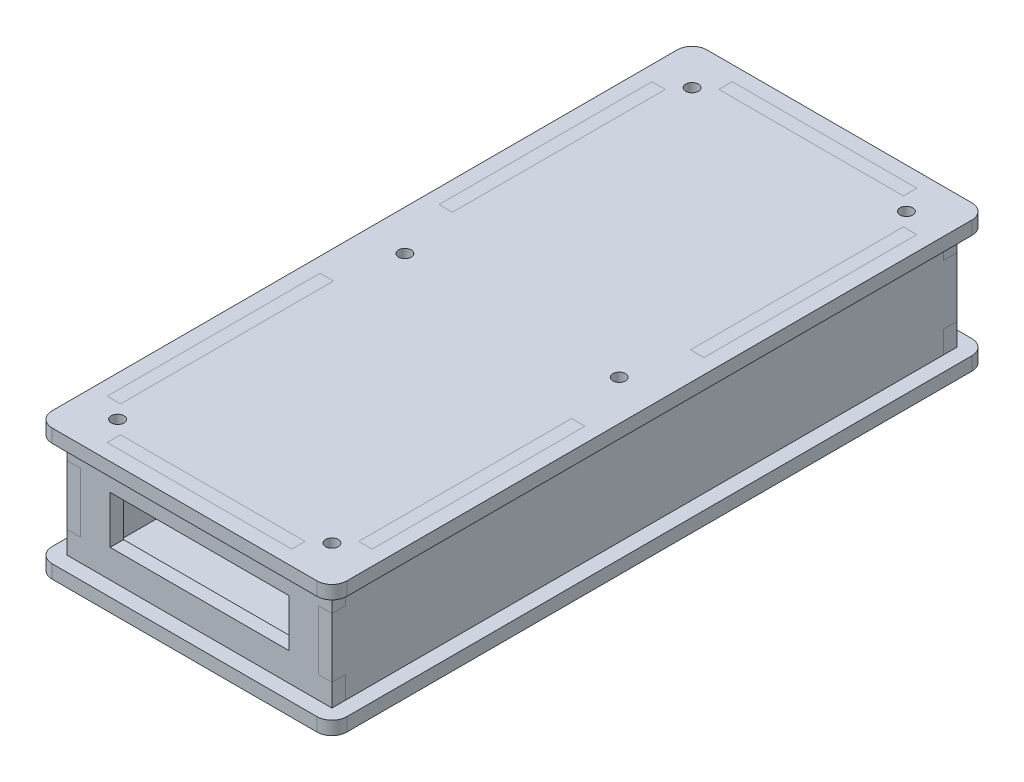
from build123d import *

# Parameters (mm, degrees)
SKETCH2_R           = 2.125
SKETCH2_W           = 62
SKETCH2_H           = 4.5
SKETCH2_W_2         = 4.5
SKETCH2_H_2         = 71.5
BOSS_EXTRUDE1_DEPTH = 4.5
BOSS_EXTRUDE2_DEPTH = 4.5
SKETCH4_W           = 60
SKETCH4_H           = 16
BOSS_EXTRUDE3_DEPTH = 4.5
BOSS_EXTRUDE4_DEPTH = 4.5
SKETCH6_W           = 4.5
SKETCH6_H           = 71.5
SKETCH6_R           = 2.125
SKETCH6_W_2         = 62
SKETCH6_H_2         = 4.5
BOSS_EXTRUDE5_DEPTH = 4.5


with BuildPart() as part:
    # Sketch2 → Boss-Extrude1 (new body)
    with BuildSketch(Plane(origin=(0, 0, 0), x_dir=(1, 0, 0), z_dir=(0, 1, 0))):
        with BuildLine():
            Line((-44.5, 72), (44.5, 72))
            ThreePointArc((44.5, 72), (48.035533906, 70.535533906), (49.5, 67))
            Line((49.5, 67), (49.5, -143))
            ThreePointArc((49.5, -143), (48.035533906, -146.535533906), (44.5, -148))
            Line((44.5, -148), (-44.5, -148))
            ThreePointArc((-44.5, -148), (-48.035533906, -146.535533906), (-49.5, -143))
            Line((-49.5, -143), (-49.5, 67))
            ThreePointArc((-49.5, 67), (-48.035533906, 70.535533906), (-44.5, 72))
        make_face()
        with Locations(Location((-36, 58.5, 0), (0, 0, 270))):
            Circle(SKETCH2_R, mode=Mode.SUBTRACT)
        with Locations(Location((36, 58.5, 0), (0, 0, 270))):
            Circle(SKETCH2_R, mode=Mode.SUBTRACT)
        with Locations(Location((36, -38, 0), (0, 0, 270))):
            Circle(SKETCH2_R, mode=Mode.SUBTRACT)
        with Locations(Location((36, -134.5, 0), (0, 0, 270))):
            Circle(SKETCH2_R, mode=Mode.SUBTRACT)
        with Locations(Location((-36, -134.5, 0), (0, 0, 270))):
            Circle(SKETCH2_R, mode=Mode.SUBTRACT)
        with Locations(Location((-36, -38, 0), (0, 0, 270))):
            Circle(SKETCH2_R, mode=Mode.SUBTRACT)
        with Locations((0, 64.75)):
            Rectangle(SKETCH2_W, SKETCH2_H, mode=Mode.SUBTRACT)
        with Locations((0, -140.75)):
            Rectangle(SKETCH2_W, SKETCH2_H, mode=Mode.SUBTRACT)
        with Locations((-42.25, 17.75)):
            Rectangle(SKETCH2_W_2, SKETCH2_H_2, mode=Mode.SUBTRACT)
        with Locations((-42.25, -93.75)):
            Rectangle(SKETCH2_W_2, SKETCH2_H_2, mode=Mode.SUBTRACT)
        with Locations((42.25, 17.75)):
            Rectangle(SKETCH2_W_2, SKETCH2_H_2, mode=Mode.SUBTRACT)
        with Locations((42.25, -93.75)):
            Rectangle(SKETCH2_W_2, SKETCH2_H_2, mode=Mode.SUBTRACT)
    extrude(amount=BOSS_EXTRUDE1_DEPTH)


with BuildPart() as body_2:
    # Sketch3 → Boss-Extrude2 (new body)
    with BuildSketch(Plane(origin=(0, 0, -62.5), x_dir=(-1, 0, 0), z_dir=(0, 0, -1))):
        Polygon((-44.5, 4.5), (-31, 4.5), (-31, 0), (31, 0), (31, 4.5), (44.5, 4.5), (44.5, 12), (40, 12), (40, 32), (44.5, 32), (44.5, 39.5), (31, 39.5), (31, 44), (-31, 44), (-31, 39.5), (-44.5, 39.5), (-44.5, 32), (-40, 32), (-40, 12), (-44.5, 12), align=None)
    extrude(amount=BOSS_EXTRUDE2_DEPTH)


with BuildPart() as body_3:
    # Sketch4 → Boss-Extrude3 (new body)
    with BuildSketch(Plane.XY.offset(138.5)):
        Polygon((44.5, 4.5), (44.5, 12), (40, 12), (40, 32), (44.5, 32), (44.5, 39.5), (31, 39.5), (31, 44), (-31, 44), (-31, 39.5), (-44.5, 39.5), (-44.5, 32), (-40, 32), (-40, 12), (-44.5, 12), (-44.5, 4.5), (-31, 4.5), (-31, 0), (31, 0), (31, 4.5), align=None)
        with Locations((0, 22)):
            Rectangle(SKETCH4_W, SKETCH4_H, mode=Mode.SUBTRACT)
    extrude(amount=BOSS_EXTRUDE3_DEPTH)


with BuildPart() as body_4:
    # Sketch5 → Boss-Extrude4 (new body)
    with BuildSketch(Plane.ZY.offset(40)):
        Polygon((-67, 32), (-67, 12), (-62.5, 12), (-62.5, 4.5), (-53.5, 4.5), (-53.5, 0), (18, 0), (18, 4.5), (58, 4.5), (58, 0), (129.5, 0), (129.5, 4.5), (138.5, 4.5), (138.5, 12), (143, 12), (143, 32), (138.5, 32), (138.5, 39.5), (129.5, 39.5), (129.5, 44), (58, 44), (58, 39.5), (18, 39.5), (18, 44), (-53.5, 44), (-53.5, 39.5), (-62.5, 39.5), (-62.5, 32), align=None)
    extrude(amount=BOSS_EXTRUDE4_DEPTH)


with BuildPart() as body_5:
    # Mirror1: mirrored copy
    add(body_4.part.mirror(Plane(origin=(0, 0, 0), x_dir=(0, 0, 1), z_dir=(1, 0, 0))))


with BuildPart() as body_6:
    # Sketch6 → Boss-Extrude5 (new body)
    with BuildSketch(Plane(origin=(0, 39.5, 0), x_dir=(1, 0, 0), z_dir=(0, 1, 0))):
        with BuildLine():
            ThreePointArc((-44.5, 72), (-48.035533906, 70.535533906), (-49.5, 67))
            Line((-49.5, 67), (-49.5, -143))
            ThreePointArc((-49.5, -143), (-48.035533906, -146.535533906), (-44.5, -148))
            Line((-44.5, -148), (44.5, -148))
            ThreePointArc((44.5, -148), (48.035533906, -146.535533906), (49.5, -143))
            Line((49.5, -143), (49.5, 67))
            ThreePointArc((49.5, 67), (48.035533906, 70.535533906), (44.5, 72))
            Line((44.5, 72), (-44.5, 72))
        make_face()
        with Locations((-42.25, -93.75)):
            Rectangle(SKETCH6_W, SKETCH6_H, mode=Mode.SUBTRACT)
        with Locations((-42.25, 17.75)):
            Rectangle(SKETCH6_W, SKETCH6_H, mode=Mode.SUBTRACT)
        with Locations(Location((-36, -134.5, 0), (0, 0, 270))):
            Circle(SKETCH6_R, mode=Mode.SUBTRACT)
        with Locations((0, -140.75)):
            Rectangle(SKETCH6_W_2, SKETCH6_H_2, mode=Mode.SUBTRACT)
        with Locations((42.25, 17.75)):
            Rectangle(SKETCH6_W, SKETCH6_H, mode=Mode.SUBTRACT)
        with Locations(Location((36, 58.5, 0), (0, 0, 270))):
            Circle(SKETCH6_R, mode=Mode.SUBTRACT)
        with Locations(Location((-36, -38, 0), (0, 0, 270))):
            Circle(SKETCH6_R, mode=Mode.SUBTRACT)
        with Locations(Location((36, -134.5, 0), (0, 0, 270))):
            Circle(SKETCH6_R, mode=Mode.SUBTRACT)
        with Locations((42.25, -93.75)):
            Rectangle(SKETCH6_W, SKETCH6_H, mode=Mode.SUBTRACT)
        with Locations(Location((36, -38, 0), (0, 0, 270))):
            Circle(SKETCH6_R, mode=Mode.SUBTRACT)
        with Locations(Location((-36, 58.5, 0), (0, 0, 270))):
            Circle(SKETCH6_R, mode=Mode.SUBTRACT)
        with Locations((0, 64.75)):
            Rectangle(SKETCH6_W_2, SKETCH6_H_2, mode=Mode.SUBTRACT)
    extrude(amount=BOSS_EXTRUDE5_DEPTH)


solid = Compound([part.part, body_2.part, body_3.part, body_4.part, body_5.part, body_6.part])
